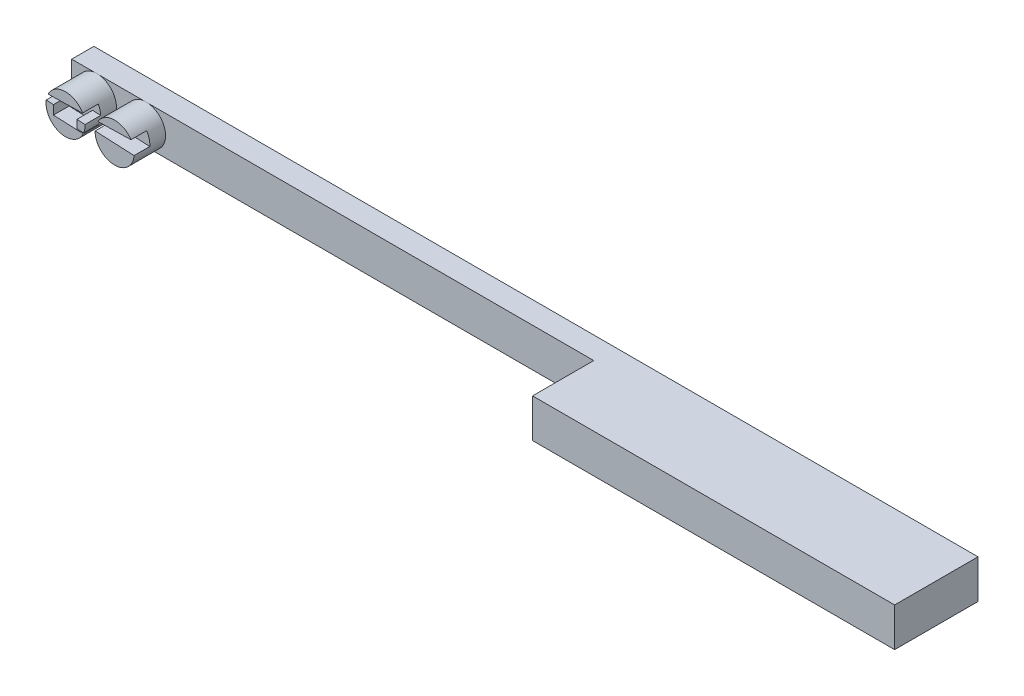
from build123d import *

# Parameters (mm, degrees)
EXTRUDE1_DEPTH     = 3.5052
SKETCH2_R          = 1.7653
EXTRUDE2_DEPTH     = 2.8448
CUT_EXTRUDE1_DEPTH = 1.4224
SKETCH4_R          = 1.7653
EXTRUDE3_DEPTH     = 2.8448
CUT_EXTRUDE2_DEPTH = 1.4224


with BuildPart() as part:
    # Sketch1 → Extrude1 (new body)
    with BuildSketch(Plane(origin=(0, -1.7526, 0), x_dir=(-1, 0, 0), z_dir=(0, 1, 0))):
        Polygon((55.372, -1.0033), (55.372, 1.0033), (8.128, 1.0033), (8.128, 6.5405), (-24.638, 6.5405), (-24.638, -1.0033), align=None)
    extrude(amount=EXTRUDE1_DEPTH)

    # Sketch2 → Extrude2 (add)
    with BuildSketch(Plane.XY.offset(1.0033)):
        with Locations(Location((-53.086, 0, 0), (0, 0, 96.876872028))):
            Circle(SKETCH2_R)
    extrude(amount=EXTRUDE2_DEPTH)

    # Sketch3 → Cut-Extrude1 (cut)
    with BuildSketch(Plane.XY.offset(3.8481)):
        Polygon((-54.1782, 0.611517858), (-54.1782, -0.611517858), (-40.41902, -1.223035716), (-52.05984, -0.611517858), (-52.05984, 0.611517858), (-40.41902, 1.223035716), align=None)
    extrude(amount=-CUT_EXTRUDE1_DEPTH, mode=Mode.SUBTRACT)

    # Sketch4 → Extrude3 (add)
    with BuildSketch(Plane.XY.offset(1.0033)):
        with Locations(Location((-48.641, 0, 0), (0, 0, 96.876872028))):
            Circle(SKETCH4_R)
    extrude(amount=EXTRUDE3_DEPTH)

    # Sketch5 → Cut-Extrude2 (cut)
    with BuildSketch(Plane.XY.offset(3.8481)):
        Polygon((-62.4332, 0.611517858), (-37.0332, -0.611517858), (-35.97402, -1.223035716), (-34.91484, -0.611517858), (-34.91484, 0.611517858), (-35.97402, 1.223035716), align=None)
    extrude(amount=-CUT_EXTRUDE2_DEPTH, mode=Mode.SUBTRACT)


solid = part.part
